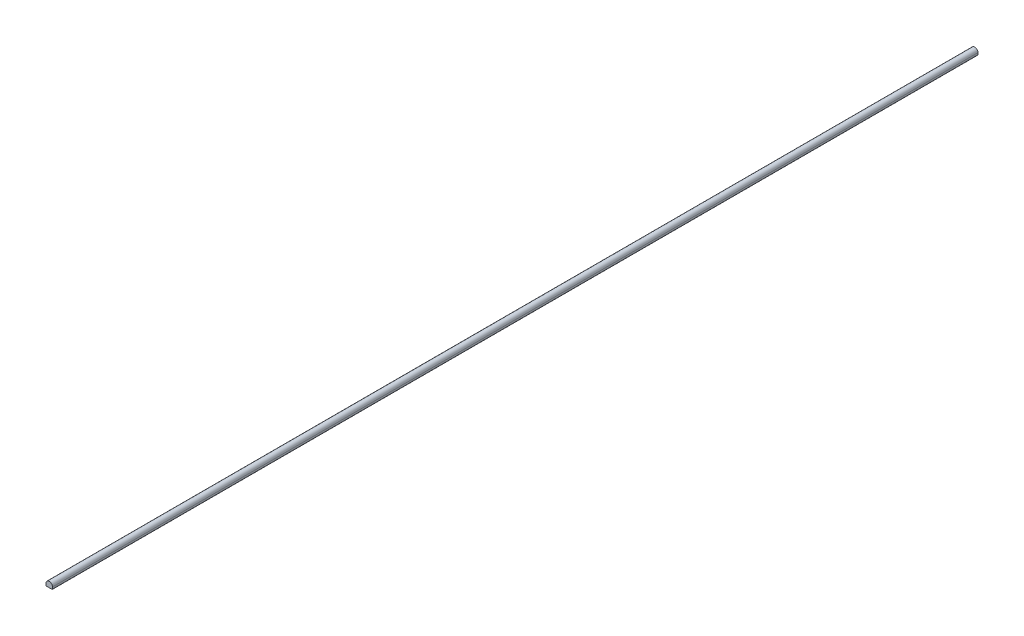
ISO-10303-21;
HEADER;
FILE_DESCRIPTION(('STEP AP214'),'2;1');
FILE_NAME('part.step','',(''),(''),'','','');
FILE_SCHEMA(('AUTOMOTIVE_DESIGN { 1 0 10303 214 1 1 1 1 }'));
ENDSEC;
DATA;
#1=APPLICATION_CONTEXT('core data for automotive mechanical design processes');
#2=APPLICATION_PROTOCOL_DEFINITION('international standard','automotive_design',2000,#1);
#3=PRODUCT_CONTEXT('',#1,'mechanical');
#4=PRODUCT('Part','Part','',(#3));
#5=PRODUCT_RELATED_PRODUCT_CATEGORY('part','',(#4));
#6=PRODUCT_DEFINITION_FORMATION('','',#4);
#7=PRODUCT_DEFINITION_CONTEXT('part definition',#1,'design');
#8=PRODUCT_DEFINITION('design','',#6,#7);
#9=PRODUCT_DEFINITION_SHAPE('','',#8);
#10=(LENGTH_UNIT() NAMED_UNIT(*) SI_UNIT(.MILLI.,.METRE.));
#11=(NAMED_UNIT(*) PLANE_ANGLE_UNIT() SI_UNIT($,.RADIAN.));
#12=(NAMED_UNIT(*) SI_UNIT($,.STERADIAN.) SOLID_ANGLE_UNIT());
#13=UNCERTAINTY_MEASURE_WITH_UNIT(LENGTH_MEASURE(1.E-05),#10,'distance_accuracy_value','');
#14=(GEOMETRIC_REPRESENTATION_CONTEXT(3) GLOBAL_UNCERTAINTY_ASSIGNED_CONTEXT((#13)) GLOBAL_UNIT_ASSIGNED_CONTEXT((#10,
#11,#12)) REPRESENTATION_CONTEXT('',''));
#15=CARTESIAN_POINT('',(0.,0.,0.));
#16=DIRECTION('',(0.,0.,1.));
#17=DIRECTION('',(1.,0.,0.));
#18=AXIS2_PLACEMENT_3D('',#15,#16,#17);
#19=CARTESIAN_POINT('',(14.,0.,2000.));
#20=DIRECTION('',(0.,1.,0.));
#21=DIRECTION('',(-1.,0.,0.));
#22=AXIS2_PLACEMENT_3D('',#19,#20,#21);
#23=PLANE('',#22);
#24=DIRECTION('',(1.,0.,0.));
#25=VECTOR('',#24,1.);
#26=CARTESIAN_POINT('',(14.,0.,2000.));
#27=LINE('',#26,#25);
#28=CARTESIAN_POINT('',(0.999999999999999,0.,2000.));
#29=VERTEX_POINT('',#28);
#30=CARTESIAN_POINT('',(13.,0.,2000.));
#31=VERTEX_POINT('',#30);
#32=EDGE_CURVE('E99',#29,#31,#27,.T.);
#33=ORIENTED_EDGE('',*,*,#32,.F.);
#34=DIRECTION('',(0.,0.,-1.));
#35=VECTOR('',#34,1.);
#36=CARTESIAN_POINT('',(0.999999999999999,0.,2000.));
#37=LINE('',#36,#35);
#38=CARTESIAN_POINT('',(0.999999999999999,0.,0.));
#39=VERTEX_POINT('',#38);
#40=EDGE_CURVE('E128',#29,#39,#37,.T.);
#41=ORIENTED_EDGE('',*,*,#40,.T.);
#42=DIRECTION('',(1.,0.,0.));
#43=VECTOR('',#42,1.);
#44=CARTESIAN_POINT('',(14.,0.,0.));
#45=LINE('',#44,#43);
#46=CARTESIAN_POINT('',(13.,0.,0.));
#47=VERTEX_POINT('',#46);
#48=EDGE_CURVE('E118',#39,#47,#45,.T.);
#49=ORIENTED_EDGE('',*,*,#48,.T.);
#50=DIRECTION('',(0.,0.,-1.));
#51=VECTOR('',#50,1.);
#52=CARTESIAN_POINT('',(13.,0.,2000.));
#53=LINE('',#52,#51);
#54=EDGE_CURVE('E108',#47,#31,#53,.F.);
#55=ORIENTED_EDGE('',*,*,#54,.T.);
#56=EDGE_LOOP('',(#33,#41,#49,#55));
#57=FACE_BOUND('',#56,.T.);
#58=ADVANCED_FACE('F38',(#57),#23,.F.);
#59=CARTESIAN_POINT('',(14.,5.00000000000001,2000.));
#60=DIRECTION('',(-1.,0.,0.));
#61=DIRECTION('',(0.,-1.,0.));
#62=AXIS2_PLACEMENT_3D('',#59,#60,#61);
#63=PLANE('',#62);
#64=DIRECTION('',(0.,1.,0.));
#65=VECTOR('',#64,1.);
#66=CARTESIAN_POINT('',(14.,5.00000000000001,2000.));
#67=LINE('',#66,#65);
#68=CARTESIAN_POINT('',(14.,1.,2000.));
#69=VERTEX_POINT('',#68);
#70=CARTESIAN_POINT('',(14.,5.00000000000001,2000.));
#71=VERTEX_POINT('',#70);
#72=EDGE_CURVE('E91',#69,#71,#67,.T.);
#73=ORIENTED_EDGE('',*,*,#72,.F.);
#74=DIRECTION('',(0.,0.,-1.));
#75=VECTOR('',#74,1.);
#76=CARTESIAN_POINT('',(14.,1.,2000.));
#77=LINE('',#76,#75);
#78=CARTESIAN_POINT('',(14.,1.,0.));
#79=VERTEX_POINT('',#78);
#80=EDGE_CURVE('E11',#69,#79,#77,.T.);
#81=ORIENTED_EDGE('',*,*,#80,.T.);
#82=DIRECTION('',(0.,1.,0.));
#83=VECTOR('',#82,1.);
#84=CARTESIAN_POINT('',(14.,5.00000000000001,0.));
#85=LINE('',#84,#83);
#86=CARTESIAN_POINT('',(14.,5.00000000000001,0.));
#87=VERTEX_POINT('',#86);
#88=EDGE_CURVE('E105',#79,#87,#85,.T.);
#89=ORIENTED_EDGE('',*,*,#88,.T.);
#90=DIRECTION('',(0.,0.,-1.));
#91=VECTOR('',#90,1.);
#92=CARTESIAN_POINT('',(14.,5.00000000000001,2000.));
#93=LINE('',#92,#91);
#94=EDGE_CURVE('E102',#71,#87,#93,.T.);
#95=ORIENTED_EDGE('',*,*,#94,.F.);
#96=EDGE_LOOP('',(#73,#81,#89,#95));
#97=FACE_BOUND('',#96,.T.);
#98=ADVANCED_FACE('F103',(#97),#63,.F.);
#99=CARTESIAN_POINT('',(7.,5.,2000.));
#100=DIRECTION('',(0.,0.,-1.));
#101=DIRECTION('',(-1.,0.,0.));
#102=AXIS2_PLACEMENT_3D('',#99,#100,#101);
#103=CYLINDRICAL_SURFACE('',#102,7.);
#104=CARTESIAN_POINT('',(7.,5.,0.));
#105=DIRECTION('',(0.,0.,1.));
#106=DIRECTION('',(-1.,0.,0.));
#107=AXIS2_PLACEMENT_3D('',#104,#105,#106);
#108=CIRCLE('',#107,7.);
#109=CARTESIAN_POINT('',(0.,5.,0.));
#110=VERTEX_POINT('',#109);
#111=EDGE_CURVE('E122',#87,#110,#108,.T.);
#112=ORIENTED_EDGE('',*,*,#111,.T.);
#113=DIRECTION('',(0.,0.,-1.));
#114=VECTOR('',#113,1.);
#115=CARTESIAN_POINT('',(0.,5.,2000.));
#116=LINE('',#115,#114);
#117=CARTESIAN_POINT('',(0.,5.,2000.));
#118=VERTEX_POINT('',#117);
#119=EDGE_CURVE('E109',#118,#110,#116,.T.);
#120=ORIENTED_EDGE('',*,*,#119,.F.);
#121=CARTESIAN_POINT('',(7.,5.,2000.));
#122=DIRECTION('',(0.,0.,1.));
#123=DIRECTION('',(-1.,0.,0.));
#124=AXIS2_PLACEMENT_3D('',#121,#122,#123);
#125=CIRCLE('',#124,7.);
#126=EDGE_CURVE('E95',#71,#118,#125,.T.);
#127=ORIENTED_EDGE('',*,*,#126,.F.);
#128=ORIENTED_EDGE('',*,*,#94,.T.);
#129=EDGE_LOOP('',(#112,#120,#127,#128));
#130=FACE_BOUND('',#129,.T.);
#131=ADVANCED_FACE('F111',(#130),#103,.T.);
#132=CARTESIAN_POINT('',(0.,0.,2000.));
#133=DIRECTION('',(1.,0.,0.));
#134=DIRECTION('',(0.,0.,-1.));
#135=AXIS2_PLACEMENT_3D('',#132,#133,#134);
#136=PLANE('',#135);
#137=DIRECTION('',(0.,-1.,0.));
#138=VECTOR('',#137,1.);
#139=CARTESIAN_POINT('',(0.,0.,0.));
#140=LINE('',#139,#138);
#141=CARTESIAN_POINT('',(0.,1.,0.));
#142=VERTEX_POINT('',#141);
#143=EDGE_CURVE('E124',#110,#142,#140,.T.);
#144=ORIENTED_EDGE('',*,*,#143,.T.);
#145=DIRECTION('',(0.,0.,-1.));
#146=VECTOR('',#145,1.);
#147=CARTESIAN_POINT('',(0.,1.,2000.));
#148=LINE('',#147,#146);
#149=CARTESIAN_POINT('',(0.,1.,2000.));
#150=VERTEX_POINT('',#149);
#151=EDGE_CURVE('E61',#142,#150,#148,.F.);
#152=ORIENTED_EDGE('',*,*,#151,.T.);
#153=DIRECTION('',(0.,-1.,0.));
#154=VECTOR('',#153,1.);
#155=CARTESIAN_POINT('',(0.,0.,2000.));
#156=LINE('',#155,#154);
#157=EDGE_CURVE('E113',#118,#150,#156,.T.);
#158=ORIENTED_EDGE('',*,*,#157,.F.);
#159=ORIENTED_EDGE('',*,*,#119,.T.);
#160=EDGE_LOOP('',(#144,#152,#158,#159));
#161=FACE_BOUND('',#160,.T.);
#162=ADVANCED_FACE('F147',(#161),#136,.F.);
#163=CARTESIAN_POINT('',(7.,5.,2000.));
#164=DIRECTION('',(0.,0.,-1.));
#165=DIRECTION('',(-1.,0.,0.));
#166=AXIS2_PLACEMENT_3D('',#163,#164,#165);
#167=PLANE('',#166);
#168=ORIENTED_EDGE('',*,*,#157,.T.);
#169=CARTESIAN_POINT('',(0.999999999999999,1.,2000.));
#170=DIRECTION('',(0.,0.,-1.));
#171=DIRECTION('',(-1.,0.,0.));
#172=AXIS2_PLACEMENT_3D('',#169,#170,#171);
#173=CIRCLE('',#172,1.);
#174=EDGE_CURVE('E46',#150,#29,#173,.F.);
#175=ORIENTED_EDGE('',*,*,#174,.T.);
#176=ORIENTED_EDGE('',*,*,#32,.T.);
#177=CARTESIAN_POINT('',(13.,1.,2000.));
#178=DIRECTION('',(0.,0.,-1.));
#179=DIRECTION('',(-1.,0.,0.));
#180=AXIS2_PLACEMENT_3D('',#177,#178,#179);
#181=CIRCLE('',#180,1.);
#182=EDGE_CURVE('E53',#31,#69,#181,.F.);
#183=ORIENTED_EDGE('',*,*,#182,.T.);
#184=ORIENTED_EDGE('',*,*,#72,.T.);
#185=ORIENTED_EDGE('',*,*,#126,.T.);
#186=EDGE_LOOP('',(#168,#175,#176,#183,#184,#185));
#187=FACE_BOUND('',#186,.T.);
#188=ADVANCED_FACE('F93',(#187),#167,.F.);
#189=CARTESIAN_POINT('',(7.,5.,0.));
#190=DIRECTION('',(0.,0.,-1.));
#191=DIRECTION('',(-1.,0.,0.));
#192=AXIS2_PLACEMENT_3D('',#189,#190,#191);
#193=PLANE('',#192);
#194=ORIENTED_EDGE('',*,*,#48,.F.);
#195=CARTESIAN_POINT('',(0.999999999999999,1.,0.));
#196=DIRECTION('',(0.,0.,-1.));
#197=DIRECTION('',(-1.,0.,0.));
#198=AXIS2_PLACEMENT_3D('',#195,#196,#197);
#199=CIRCLE('',#198,1.);
#200=EDGE_CURVE('E133',#39,#142,#199,.T.);
#201=ORIENTED_EDGE('',*,*,#200,.T.);
#202=ORIENTED_EDGE('',*,*,#143,.F.);
#203=ORIENTED_EDGE('',*,*,#111,.F.);
#204=ORIENTED_EDGE('',*,*,#88,.F.);
#205=CARTESIAN_POINT('',(13.,1.,0.));
#206=DIRECTION('',(0.,0.,-1.));
#207=DIRECTION('',(-1.,0.,0.));
#208=AXIS2_PLACEMENT_3D('',#205,#206,#207);
#209=CIRCLE('',#208,1.);
#210=EDGE_CURVE('E131',#79,#47,#209,.T.);
#211=ORIENTED_EDGE('',*,*,#210,.T.);
#212=EDGE_LOOP('',(#194,#201,#202,#203,#204,#211));
#213=FACE_BOUND('',#212,.T.);
#214=ADVANCED_FACE('F146',(#213),#193,.T.);
#215=CARTESIAN_POINT('',(0.999999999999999,1.,2000.));
#216=DIRECTION('',(0.,0.,-1.));
#217=DIRECTION('',(-1.,0.,0.));
#218=AXIS2_PLACEMENT_3D('',#215,#216,#217);
#219=CYLINDRICAL_SURFACE('',#218,1.);
#220=ORIENTED_EDGE('',*,*,#174,.F.);
#221=ORIENTED_EDGE('',*,*,#151,.F.);
#222=ORIENTED_EDGE('',*,*,#200,.F.);
#223=ORIENTED_EDGE('',*,*,#40,.F.);
#224=EDGE_LOOP('',(#220,#221,#222,#223));
#225=FACE_BOUND('',#224,.T.);
#226=ADVANCED_FACE('F143',(#225),#219,.T.);
#227=CARTESIAN_POINT('',(13.,1.,2000.));
#228=DIRECTION('',(0.,0.,-1.));
#229=DIRECTION('',(-1.,0.,0.));
#230=AXIS2_PLACEMENT_3D('',#227,#228,#229);
#231=CYLINDRICAL_SURFACE('',#230,1.);
#232=ORIENTED_EDGE('',*,*,#182,.F.);
#233=ORIENTED_EDGE('',*,*,#54,.F.);
#234=ORIENTED_EDGE('',*,*,#210,.F.);
#235=ORIENTED_EDGE('',*,*,#80,.F.);
#236=EDGE_LOOP('',(#232,#233,#234,#235));
#237=FACE_BOUND('',#236,.T.);
#238=ADVANCED_FACE('F40',(#237),#231,.T.);
#239=CLOSED_SHELL('',(#58,#98,#131,#162,#188,#214,#226,#238));
#240=MANIFOLD_SOLID_BREP('B2',#239);
#241=ADVANCED_BREP_SHAPE_REPRESENTATION('',(#18,#240),#14);
#242=SHAPE_DEFINITION_REPRESENTATION(#9,#241);
ENDSEC;
END-ISO-10303-21;
